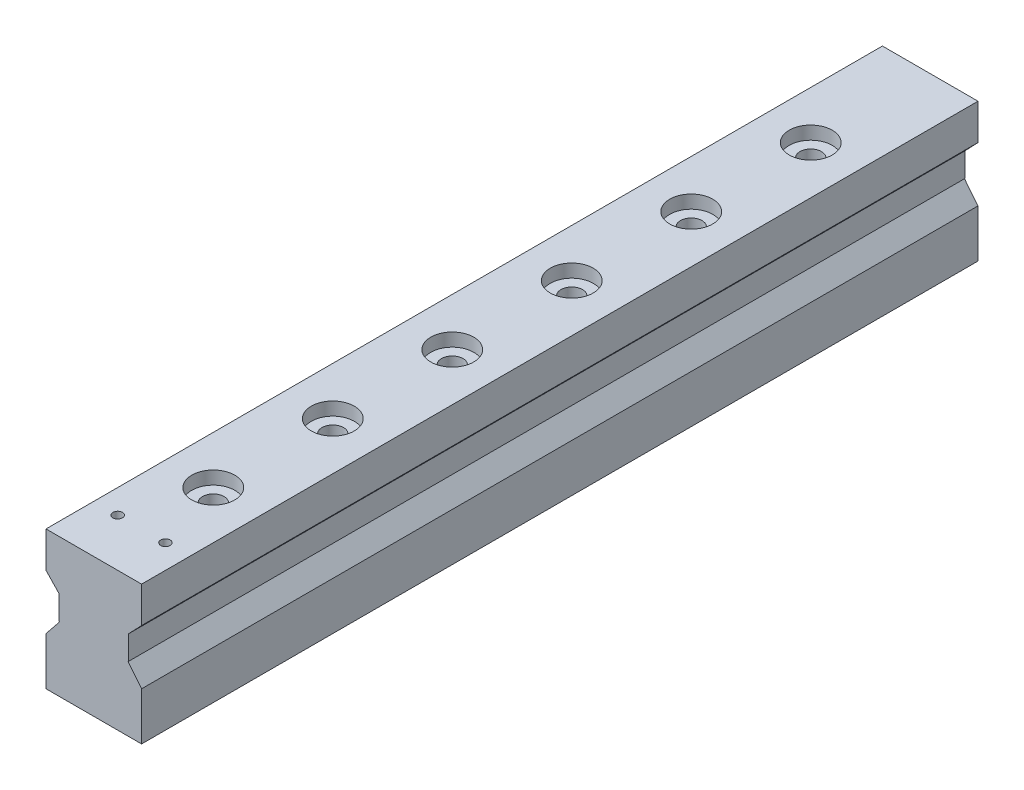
ISO-10303-21;
HEADER;
FILE_DESCRIPTION(('STEP AP214'),'2;1');
FILE_NAME('part.step','',(''),(''),'','','');
FILE_SCHEMA(('AUTOMOTIVE_DESIGN { 1 0 10303 214 1 1 1 1 }'));
ENDSEC;
DATA;
#1=APPLICATION_CONTEXT('core data for automotive mechanical design processes');
#2=APPLICATION_PROTOCOL_DEFINITION('international standard','automotive_design',2000,#1);
#3=PRODUCT_CONTEXT('',#1,'mechanical');
#4=PRODUCT('Part','Part','',(#3));
#5=PRODUCT_RELATED_PRODUCT_CATEGORY('part','',(#4));
#6=PRODUCT_DEFINITION_FORMATION('','',#4);
#7=PRODUCT_DEFINITION_CONTEXT('part definition',#1,'design');
#8=PRODUCT_DEFINITION('design','',#6,#7);
#9=PRODUCT_DEFINITION_SHAPE('','',#8);
#10=(LENGTH_UNIT() NAMED_UNIT(*) SI_UNIT(.MILLI.,.METRE.));
#11=(NAMED_UNIT(*) PLANE_ANGLE_UNIT() SI_UNIT($,.RADIAN.));
#12=(NAMED_UNIT(*) SI_UNIT($,.STERADIAN.) SOLID_ANGLE_UNIT());
#13=UNCERTAINTY_MEASURE_WITH_UNIT(LENGTH_MEASURE(1.E-05),#10,'distance_accuracy_value','');
#14=(GEOMETRIC_REPRESENTATION_CONTEXT(3) GLOBAL_UNCERTAINTY_ASSIGNED_CONTEXT((#13)) GLOBAL_UNIT_ASSIGNED_CONTEXT((#10,
#11,#12)) REPRESENTATION_CONTEXT('',''));
#15=CARTESIAN_POINT('',(0.,0.,0.));
#16=DIRECTION('',(0.,0.,1.));
#17=DIRECTION('',(1.,0.,0.));
#18=AXIS2_PLACEMENT_3D('',#15,#16,#17);
#19=CARTESIAN_POINT('',(-7.19228731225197,43.2311611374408,350.));
#20=DIRECTION('',(1.,0.,0.));
#21=DIRECTION('',(0.,1.,0.));
#22=AXIS2_PLACEMENT_3D('',#19,#20,#21);
#23=PLANE('',#22);
#24=DIRECTION('',(0.,-1.,0.));
#25=VECTOR('',#24,1.);
#26=CARTESIAN_POINT('',(-7.19228731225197,43.2311611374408,0.));
#27=LINE('',#26,#25);
#28=CARTESIAN_POINT('',(-7.19228731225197,43.2311611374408,0.));
#29=VERTEX_POINT('',#28);
#30=CARTESIAN_POINT('',(-7.19228731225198,28.2311611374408,0.));
#31=VERTEX_POINT('',#30);
#32=EDGE_CURVE('E170',#29,#31,#27,.T.);
#33=ORIENTED_EDGE('',*,*,#32,.T.);
#34=DIRECTION('',(0.,0.,-1.));
#35=VECTOR('',#34,1.);
#36=CARTESIAN_POINT('',(-7.19228731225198,28.2311611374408,350.));
#37=LINE('',#36,#35);
#38=CARTESIAN_POINT('',(-7.19228731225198,28.2311611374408,350.));
#39=VERTEX_POINT('',#38);
#40=EDGE_CURVE('E228',#39,#31,#37,.T.);
#41=ORIENTED_EDGE('',*,*,#40,.F.);
#42=DIRECTION('',(0.,-1.,0.));
#43=VECTOR('',#42,1.);
#44=CARTESIAN_POINT('',(-7.19228731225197,43.2311611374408,350.));
#45=LINE('',#44,#43);
#46=CARTESIAN_POINT('',(-7.19228731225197,43.2311611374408,350.));
#47=VERTEX_POINT('',#46);
#48=EDGE_CURVE('E197',#47,#39,#45,.T.);
#49=ORIENTED_EDGE('',*,*,#48,.F.);
#50=DIRECTION('',(0.,0.,-1.));
#51=VECTOR('',#50,1.);
#52=CARTESIAN_POINT('',(-7.19228731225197,43.2311611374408,350.));
#53=LINE('',#52,#51);
#54=EDGE_CURVE('E166',#47,#29,#53,.T.);
#55=ORIENTED_EDGE('',*,*,#54,.T.);
#56=EDGE_LOOP('',(#33,#41,#49,#55));
#57=FACE_BOUND('',#56,.T.);
#58=ADVANCED_FACE('F33',(#57),#23,.F.);
#59=CARTESIAN_POINT('',(-1.69228731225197,22.4619448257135,350.));
#60=DIRECTION('',(0.723792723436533,0.69001745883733,0.));
#61=DIRECTION('',(-0.69001745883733,0.723792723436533,0.));
#62=AXIS2_PLACEMENT_3D('',#59,#60,#61);
#63=PLANE('',#62);
#64=DIRECTION('',(0.69001745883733,-0.723792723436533,0.));
#65=VECTOR('',#64,1.);
#66=CARTESIAN_POINT('',(-1.69228731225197,22.4619448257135,0.));
#67=LINE('',#66,#65);
#68=CARTESIAN_POINT('',(-1.69228731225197,22.4619448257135,0.));
#69=VERTEX_POINT('',#68);
#70=EDGE_CURVE('E173',#31,#69,#67,.T.);
#71=ORIENTED_EDGE('',*,*,#70,.T.);
#72=DIRECTION('',(0.,0.,-1.));
#73=VECTOR('',#72,1.);
#74=CARTESIAN_POINT('',(-1.69228731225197,22.4619448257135,350.));
#75=LINE('',#74,#73);
#76=CARTESIAN_POINT('',(-1.69228731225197,22.4619448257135,350.));
#77=VERTEX_POINT('',#76);
#78=EDGE_CURVE('E225',#77,#69,#75,.T.);
#79=ORIENTED_EDGE('',*,*,#78,.F.);
#80=DIRECTION('',(0.69001745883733,-0.723792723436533,0.));
#81=VECTOR('',#80,1.);
#82=CARTESIAN_POINT('',(-1.69228731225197,22.4619448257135,350.));
#83=LINE('',#82,#81);
#84=EDGE_CURVE('E113',#39,#77,#83,.T.);
#85=ORIENTED_EDGE('',*,*,#84,.F.);
#86=ORIENTED_EDGE('',*,*,#40,.T.);
#87=EDGE_LOOP('',(#71,#79,#85,#86));
#88=FACE_BOUND('',#87,.T.);
#89=ADVANCED_FACE('F303',(#88),#63,.F.);
#90=CARTESIAN_POINT('',(-1.69228731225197,22.4619448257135,350.));
#91=DIRECTION('',(1.,0.,0.));
#92=DIRECTION('',(0.,0.,-1.));
#93=AXIS2_PLACEMENT_3D('',#90,#91,#92);
#94=PLANE('',#93);
#95=DIRECTION('',(0.,-1.,0.));
#96=VECTOR('',#95,1.);
#97=CARTESIAN_POINT('',(-1.69228731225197,22.4619448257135,0.));
#98=LINE('',#97,#96);
#99=CARTESIAN_POINT('',(-1.69228731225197,12.4619448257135,0.));
#100=VERTEX_POINT('',#99);
#101=EDGE_CURVE('E176',#69,#100,#98,.T.);
#102=ORIENTED_EDGE('',*,*,#101,.T.);
#103=DIRECTION('',(0.,0.,-1.));
#104=VECTOR('',#103,1.);
#105=CARTESIAN_POINT('',(-1.69228731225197,12.4619448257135,350.));
#106=LINE('',#105,#104);
#107=CARTESIAN_POINT('',(-1.69228731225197,12.4619448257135,350.));
#108=VERTEX_POINT('',#107);
#109=EDGE_CURVE('E222',#108,#100,#106,.T.);
#110=ORIENTED_EDGE('',*,*,#109,.F.);
#111=DIRECTION('',(0.,-1.,0.));
#112=VECTOR('',#111,1.);
#113=CARTESIAN_POINT('',(-1.69228731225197,22.4619448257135,350.));
#114=LINE('',#113,#112);
#115=EDGE_CURVE('E445',#77,#108,#114,.T.);
#116=ORIENTED_EDGE('',*,*,#115,.F.);
#117=ORIENTED_EDGE('',*,*,#78,.T.);
#118=EDGE_LOOP('',(#102,#110,#116,#117));
#119=FACE_BOUND('',#118,.T.);
#120=ADVANCED_FACE('F309',(#119),#94,.F.);
#121=CARTESIAN_POINT('',(-1.69228731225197,12.4619448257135,350.));
#122=DIRECTION('',(0.,1.,0.));
#123=DIRECTION('',(0.,0.,1.));
#124=AXIS2_PLACEMENT_3D('',#121,#122,#123);
#125=PLANE('',#124);
#126=DIRECTION('',(1.,0.,0.));
#127=VECTOR('',#126,1.);
#128=CARTESIAN_POINT('',(-1.69228731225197,12.4619448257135,0.));
#129=LINE('',#128,#127);
#130=CARTESIAN_POINT('',(-1.42307100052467,12.4619448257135,0.));
#131=VERTEX_POINT('',#130);
#132=EDGE_CURVE('E178',#100,#131,#129,.T.);
#133=ORIENTED_EDGE('',*,*,#132,.T.);
#134=DIRECTION('',(0.,0.,-1.));
#135=VECTOR('',#134,1.);
#136=CARTESIAN_POINT('',(-1.42307100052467,12.4619448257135,350.));
#137=LINE('',#136,#135);
#138=CARTESIAN_POINT('',(-1.42307100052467,12.4619448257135,350.));
#139=VERTEX_POINT('',#138);
#140=EDGE_CURVE('E219',#139,#131,#137,.T.);
#141=ORIENTED_EDGE('',*,*,#140,.F.);
#142=DIRECTION('',(1.,0.,0.));
#143=VECTOR('',#142,1.);
#144=CARTESIAN_POINT('',(-1.69228731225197,12.4619448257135,350.));
#145=LINE('',#144,#143);
#146=EDGE_CURVE('E400',#108,#139,#145,.T.);
#147=ORIENTED_EDGE('',*,*,#146,.F.);
#148=ORIENTED_EDGE('',*,*,#109,.T.);
#149=EDGE_LOOP('',(#133,#141,#147,#148));
#150=FACE_BOUND('',#149,.T.);
#151=ADVANCED_FACE('F385',(#150),#125,.F.);
#152=CARTESIAN_POINT('',(-1.42307100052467,12.4619448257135,350.));
#153=DIRECTION('',(0.779014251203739,-0.627006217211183,0.));
#154=DIRECTION('',(0.627006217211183,0.779014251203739,0.));
#155=AXIS2_PLACEMENT_3D('',#152,#153,#154);
#156=PLANE('',#155);
#157=DIRECTION('',(-0.627006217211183,-0.779014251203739,0.));
#158=VECTOR('',#157,1.);
#159=CARTESIAN_POINT('',(-1.42307100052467,12.4619448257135,0.));
#160=LINE('',#159,#158);
#161=CARTESIAN_POINT('',(-7.19228731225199,5.29407056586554,0.));
#162=VERTEX_POINT('',#161);
#163=EDGE_CURVE('E180',#131,#162,#160,.T.);
#164=ORIENTED_EDGE('',*,*,#163,.T.);
#165=DIRECTION('',(0.,0.,-1.));
#166=VECTOR('',#165,1.);
#167=CARTESIAN_POINT('',(-7.19228731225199,5.29407056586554,350.));
#168=LINE('',#167,#166);
#169=CARTESIAN_POINT('',(-7.19228731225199,5.29407056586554,350.));
#170=VERTEX_POINT('',#169);
#171=EDGE_CURVE('E216',#170,#162,#168,.T.);
#172=ORIENTED_EDGE('',*,*,#171,.F.);
#173=DIRECTION('',(-0.627006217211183,-0.779014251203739,0.));
#174=VECTOR('',#173,1.);
#175=CARTESIAN_POINT('',(-1.42307100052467,12.4619448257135,350.));
#176=LINE('',#175,#174);
#177=EDGE_CURVE('E412',#139,#170,#176,.T.);
#178=ORIENTED_EDGE('',*,*,#177,.F.);
#179=ORIENTED_EDGE('',*,*,#140,.T.);
#180=EDGE_LOOP('',(#164,#172,#178,#179));
#181=FACE_BOUND('',#180,.T.);
#182=ADVANCED_FACE('F376',(#181),#156,.F.);
#183=CARTESIAN_POINT('',(-7.19228731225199,5.29407056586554,350.));
#184=DIRECTION('',(1.,0.,0.));
#185=DIRECTION('',(0.,1.,0.));
#186=AXIS2_PLACEMENT_3D('',#183,#184,#185);
#187=PLANE('',#186);
#188=DIRECTION('',(0.,-1.,0.));
#189=VECTOR('',#188,1.);
#190=CARTESIAN_POINT('',(-7.19228731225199,5.29407056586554,0.));
#191=LINE('',#190,#189);
#192=CARTESIAN_POINT('',(-7.19228731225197,-14.7059294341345,0.));
#193=VERTEX_POINT('',#192);
#194=EDGE_CURVE('E182',#162,#193,#191,.T.);
#195=ORIENTED_EDGE('',*,*,#194,.T.);
#196=DIRECTION('',(0.,0.,-1.));
#197=VECTOR('',#196,1.);
#198=CARTESIAN_POINT('',(-7.19228731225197,-14.7059294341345,350.));
#199=LINE('',#198,#197);
#200=CARTESIAN_POINT('',(-7.19228731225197,-14.7059294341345,350.));
#201=VERTEX_POINT('',#200);
#202=EDGE_CURVE('E213',#201,#193,#199,.T.);
#203=ORIENTED_EDGE('',*,*,#202,.F.);
#204=DIRECTION('',(0.,-1.,0.));
#205=VECTOR('',#204,1.);
#206=CARTESIAN_POINT('',(-7.19228731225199,5.29407056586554,350.));
#207=LINE('',#206,#205);
#208=EDGE_CURVE('E409',#170,#201,#207,.T.);
#209=ORIENTED_EDGE('',*,*,#208,.F.);
#210=ORIENTED_EDGE('',*,*,#171,.T.);
#211=EDGE_LOOP('',(#195,#203,#209,#210));
#212=FACE_BOUND('',#211,.T.);
#213=ADVANCED_FACE('F364',(#212),#187,.F.);
#214=CARTESIAN_POINT('',(-7.19228731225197,-14.7059294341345,350.));
#215=DIRECTION('',(0.,1.,0.));
#216=DIRECTION('',(0.,0.,1.));
#217=AXIS2_PLACEMENT_3D('',#214,#215,#216);
#218=PLANE('',#217);
#219=CARTESIAN_POINT('',(12.807712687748,-14.7059294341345,100.));
#220=DIRECTION('',(0.,1.,0.));
#221=DIRECTION('',(0.,0.,1.));
#222=AXIS2_PLACEMENT_3D('',#219,#220,#221);
#223=CIRCLE('',#222,4.49999999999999);
#224=CARTESIAN_POINT('',(12.807712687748,-14.7059294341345,104.5));
#225=VERTEX_POINT('',#224);
#226=EDGE_CURVE('E466',#225,#225,#223,.T.);
#227=ORIENTED_EDGE('',*,*,#226,.T.);
#228=EDGE_LOOP('',(#227));
#229=FACE_BOUND('',#228,.T.);
#230=CARTESIAN_POINT('',(12.807712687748,-14.7059294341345,50.));
#231=DIRECTION('',(0.,1.,0.));
#232=DIRECTION('',(0.,0.,1.));
#233=AXIS2_PLACEMENT_3D('',#230,#231,#232);
#234=CIRCLE('',#233,4.49999999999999);
#235=CARTESIAN_POINT('',(12.807712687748,-14.7059294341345,54.5));
#236=VERTEX_POINT('',#235);
#237=EDGE_CURVE('E174',#236,#236,#234,.T.);
#238=ORIENTED_EDGE('',*,*,#237,.T.);
#239=EDGE_LOOP('',(#238));
#240=FACE_BOUND('',#239,.T.);
#241=DIRECTION('',(1.,0.,0.));
#242=VECTOR('',#241,1.);
#243=CARTESIAN_POINT('',(-7.19228731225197,-14.7059294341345,0.));
#244=LINE('',#243,#242);
#245=CARTESIAN_POINT('',(32.807712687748,-14.7059294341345,0.));
#246=VERTEX_POINT('',#245);
#247=EDGE_CURVE('E184',#193,#246,#244,.T.);
#248=ORIENTED_EDGE('',*,*,#247,.T.);
#249=DIRECTION('',(0.,0.,-1.));
#250=VECTOR('',#249,1.);
#251=CARTESIAN_POINT('',(32.807712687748,-14.7059294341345,350.));
#252=LINE('',#251,#250);
#253=CARTESIAN_POINT('',(32.807712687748,-14.7059294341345,350.));
#254=VERTEX_POINT('',#253);
#255=EDGE_CURVE('E210',#254,#246,#252,.T.);
#256=ORIENTED_EDGE('',*,*,#255,.F.);
#257=DIRECTION('',(1.,0.,0.));
#258=VECTOR('',#257,1.);
#259=CARTESIAN_POINT('',(-7.19228731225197,-14.7059294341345,350.));
#260=LINE('',#259,#258);
#261=EDGE_CURVE('E411',#201,#254,#260,.T.);
#262=ORIENTED_EDGE('',*,*,#261,.F.);
#263=ORIENTED_EDGE('',*,*,#202,.T.);
#264=EDGE_LOOP('',(#248,#256,#262,#263));
#265=FACE_BOUND('',#264,.T.);
#266=CARTESIAN_POINT('',(12.807712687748,-14.7059294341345,150.));
#267=DIRECTION('',(0.,1.,0.));
#268=DIRECTION('',(0.,0.,1.));
#269=AXIS2_PLACEMENT_3D('',#266,#267,#268);
#270=CIRCLE('',#269,4.49999999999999);
#271=CARTESIAN_POINT('',(12.807712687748,-14.7059294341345,154.5));
#272=VERTEX_POINT('',#271);
#273=EDGE_CURVE('E233',#272,#272,#270,.T.);
#274=ORIENTED_EDGE('',*,*,#273,.T.);
#275=EDGE_LOOP('',(#274));
#276=FACE_BOUND('',#275,.T.);
#277=CARTESIAN_POINT('',(12.807712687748,-14.7059294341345,200.));
#278=DIRECTION('',(0.,1.,0.));
#279=DIRECTION('',(0.,0.,1.));
#280=AXIS2_PLACEMENT_3D('',#277,#278,#279);
#281=CIRCLE('',#280,4.49999999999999);
#282=CARTESIAN_POINT('',(12.807712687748,-14.7059294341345,204.5));
#283=VERTEX_POINT('',#282);
#284=EDGE_CURVE('E245',#283,#283,#281,.T.);
#285=ORIENTED_EDGE('',*,*,#284,.T.);
#286=EDGE_LOOP('',(#285));
#287=FACE_BOUND('',#286,.T.);
#288=CARTESIAN_POINT('',(12.807712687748,-14.7059294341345,250.));
#289=DIRECTION('',(0.,1.,0.));
#290=DIRECTION('',(0.,0.,1.));
#291=AXIS2_PLACEMENT_3D('',#288,#289,#290);
#292=CIRCLE('',#291,4.49999999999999);
#293=CARTESIAN_POINT('',(12.807712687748,-14.7059294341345,254.5));
#294=VERTEX_POINT('',#293);
#295=EDGE_CURVE('E257',#294,#294,#292,.T.);
#296=ORIENTED_EDGE('',*,*,#295,.T.);
#297=EDGE_LOOP('',(#296));
#298=FACE_BOUND('',#297,.T.);
#299=CARTESIAN_POINT('',(12.807712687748,-14.7059294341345,300.));
#300=DIRECTION('',(0.,1.,0.));
#301=DIRECTION('',(0.,0.,1.));
#302=AXIS2_PLACEMENT_3D('',#299,#300,#301);
#303=CIRCLE('',#302,4.49999999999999);
#304=CARTESIAN_POINT('',(12.807712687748,-14.7059294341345,304.5));
#305=VERTEX_POINT('',#304);
#306=EDGE_CURVE('E269',#305,#305,#303,.T.);
#307=ORIENTED_EDGE('',*,*,#306,.T.);
#308=EDGE_LOOP('',(#307));
#309=FACE_BOUND('',#308,.T.);
#310=ADVANCED_FACE('F361',(#229,#240,#265,#276,#287,#298,#309),#218,.F.);
#311=CARTESIAN_POINT('',(32.807712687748,5.29407056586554,350.));
#312=DIRECTION('',(-1.,0.,0.));
#313=DIRECTION('',(0.,-1.,0.));
#314=AXIS2_PLACEMENT_3D('',#311,#312,#313);
#315=PLANE('',#314);
#316=DIRECTION('',(0.,1.,0.));
#317=VECTOR('',#316,1.);
#318=CARTESIAN_POINT('',(32.807712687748,5.29407056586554,0.));
#319=LINE('',#318,#317);
#320=CARTESIAN_POINT('',(32.807712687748,5.29407056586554,0.));
#321=VERTEX_POINT('',#320);
#322=EDGE_CURVE('E186',#246,#321,#319,.T.);
#323=ORIENTED_EDGE('',*,*,#322,.T.);
#324=DIRECTION('',(0.,0.,-1.));
#325=VECTOR('',#324,1.);
#326=CARTESIAN_POINT('',(32.807712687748,5.29407056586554,350.));
#327=LINE('',#326,#325);
#328=CARTESIAN_POINT('',(32.807712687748,5.29407056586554,350.));
#329=VERTEX_POINT('',#328);
#330=EDGE_CURVE('E207',#329,#321,#327,.T.);
#331=ORIENTED_EDGE('',*,*,#330,.F.);
#332=DIRECTION('',(0.,1.,0.));
#333=VECTOR('',#332,1.);
#334=CARTESIAN_POINT('',(32.807712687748,5.29407056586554,350.));
#335=LINE('',#334,#333);
#336=EDGE_CURVE('E414',#254,#329,#335,.T.);
#337=ORIENTED_EDGE('',*,*,#336,.F.);
#338=ORIENTED_EDGE('',*,*,#255,.T.);
#339=EDGE_LOOP('',(#323,#331,#337,#338));
#340=FACE_BOUND('',#339,.T.);
#341=ADVANCED_FACE('F363',(#340),#315,.F.);
#342=CARTESIAN_POINT('',(27.0384963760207,12.4619448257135,350.));
#343=DIRECTION('',(-0.779014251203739,-0.627006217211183,0.));
#344=DIRECTION('',(0.627006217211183,-0.779014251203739,0.));
#345=AXIS2_PLACEMENT_3D('',#342,#343,#344);
#346=PLANE('',#345);
#347=DIRECTION('',(-0.627006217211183,0.779014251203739,0.));
#348=VECTOR('',#347,1.);
#349=CARTESIAN_POINT('',(27.0384963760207,12.4619448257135,0.));
#350=LINE('',#349,#348);
#351=CARTESIAN_POINT('',(27.0384963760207,12.4619448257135,0.));
#352=VERTEX_POINT('',#351);
#353=EDGE_CURVE('E188',#321,#352,#350,.T.);
#354=ORIENTED_EDGE('',*,*,#353,.T.);
#355=DIRECTION('',(0.,0.,-1.));
#356=VECTOR('',#355,1.);
#357=CARTESIAN_POINT('',(27.0384963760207,12.4619448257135,350.));
#358=LINE('',#357,#356);
#359=CARTESIAN_POINT('',(27.0384963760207,12.4619448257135,350.));
#360=VERTEX_POINT('',#359);
#361=EDGE_CURVE('E204',#360,#352,#358,.T.);
#362=ORIENTED_EDGE('',*,*,#361,.F.);
#363=DIRECTION('',(-0.627006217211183,0.779014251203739,0.));
#364=VECTOR('',#363,1.);
#365=CARTESIAN_POINT('',(27.0384963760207,12.4619448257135,350.));
#366=LINE('',#365,#364);
#367=EDGE_CURVE('E420',#329,#360,#366,.T.);
#368=ORIENTED_EDGE('',*,*,#367,.F.);
#369=ORIENTED_EDGE('',*,*,#330,.T.);
#370=EDGE_LOOP('',(#354,#362,#368,#369));
#371=FACE_BOUND('',#370,.T.);
#372=ADVANCED_FACE('F372',(#371),#346,.F.);
#373=CARTESIAN_POINT('',(27.307712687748,12.4619448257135,350.));
#374=DIRECTION('',(0.,1.,0.));
#375=DIRECTION('',(-1.,0.,0.));
#376=AXIS2_PLACEMENT_3D('',#373,#374,#375);
#377=PLANE('',#376);
#378=DIRECTION('',(1.,0.,0.));
#379=VECTOR('',#378,1.);
#380=CARTESIAN_POINT('',(27.307712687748,12.4619448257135,0.));
#381=LINE('',#380,#379);
#382=CARTESIAN_POINT('',(27.307712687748,12.4619448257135,0.));
#383=VERTEX_POINT('',#382);
#384=EDGE_CURVE('E190',#352,#383,#381,.T.);
#385=ORIENTED_EDGE('',*,*,#384,.T.);
#386=DIRECTION('',(0.,0.,-1.));
#387=VECTOR('',#386,1.);
#388=CARTESIAN_POINT('',(27.307712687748,12.4619448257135,350.));
#389=LINE('',#388,#387);
#390=CARTESIAN_POINT('',(27.307712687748,12.4619448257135,350.));
#391=VERTEX_POINT('',#390);
#392=EDGE_CURVE('E201',#391,#383,#389,.T.);
#393=ORIENTED_EDGE('',*,*,#392,.F.);
#394=DIRECTION('',(1.,0.,0.));
#395=VECTOR('',#394,1.);
#396=CARTESIAN_POINT('',(27.307712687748,12.4619448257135,350.));
#397=LINE('',#396,#395);
#398=EDGE_CURVE('E422',#360,#391,#397,.T.);
#399=ORIENTED_EDGE('',*,*,#398,.F.);
#400=ORIENTED_EDGE('',*,*,#361,.T.);
#401=EDGE_LOOP('',(#385,#393,#399,#400));
#402=FACE_BOUND('',#401,.T.);
#403=ADVANCED_FACE('F428',(#402),#377,.F.);
#404=CARTESIAN_POINT('',(27.307712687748,22.4619448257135,350.));
#405=DIRECTION('',(-1.,0.,0.));
#406=DIRECTION('',(0.,0.,1.));
#407=AXIS2_PLACEMENT_3D('',#404,#405,#406);
#408=PLANE('',#407);
#409=DIRECTION('',(0.,1.,0.));
#410=VECTOR('',#409,1.);
#411=CARTESIAN_POINT('',(27.307712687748,22.4619448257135,0.));
#412=LINE('',#411,#410);
#413=CARTESIAN_POINT('',(27.307712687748,22.4619448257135,0.));
#414=VERTEX_POINT('',#413);
#415=EDGE_CURVE('E192',#383,#414,#412,.T.);
#416=ORIENTED_EDGE('',*,*,#415,.T.);
#417=DIRECTION('',(0.,0.,-1.));
#418=VECTOR('',#417,1.);
#419=CARTESIAN_POINT('',(27.307712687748,22.4619448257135,350.));
#420=LINE('',#419,#418);
#421=CARTESIAN_POINT('',(27.307712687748,22.4619448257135,350.));
#422=VERTEX_POINT('',#421);
#423=EDGE_CURVE('E161',#422,#414,#420,.T.);
#424=ORIENTED_EDGE('',*,*,#423,.F.);
#425=DIRECTION('',(0.,1.,0.));
#426=VECTOR('',#425,1.);
#427=CARTESIAN_POINT('',(27.307712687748,22.4619448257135,350.));
#428=LINE('',#427,#426);
#429=EDGE_CURVE('E152',#391,#422,#428,.T.);
#430=ORIENTED_EDGE('',*,*,#429,.F.);
#431=ORIENTED_EDGE('',*,*,#392,.T.);
#432=EDGE_LOOP('',(#416,#424,#430,#431));
#433=FACE_BOUND('',#432,.T.);
#434=ADVANCED_FACE('F432',(#433),#408,.F.);
#435=CARTESIAN_POINT('',(32.807712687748,28.2311611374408,350.));
#436=DIRECTION('',(-0.723792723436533,0.69001745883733,0.));
#437=DIRECTION('',(-0.69001745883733,-0.723792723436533,0.));
#438=AXIS2_PLACEMENT_3D('',#435,#436,#437);
#439=PLANE('',#438);
#440=DIRECTION('',(0.69001745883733,0.723792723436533,0.));
#441=VECTOR('',#440,1.);
#442=CARTESIAN_POINT('',(32.807712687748,28.2311611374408,0.));
#443=LINE('',#442,#441);
#444=CARTESIAN_POINT('',(32.807712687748,28.2311611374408,0.));
#445=VERTEX_POINT('',#444);
#446=EDGE_CURVE('E160',#414,#445,#443,.T.);
#447=ORIENTED_EDGE('',*,*,#446,.T.);
#448=DIRECTION('',(0.,0.,-1.));
#449=VECTOR('',#448,1.);
#450=CARTESIAN_POINT('',(32.807712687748,28.2311611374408,350.));
#451=LINE('',#450,#449);
#452=CARTESIAN_POINT('',(32.807712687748,28.2311611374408,350.));
#453=VERTEX_POINT('',#452);
#454=EDGE_CURVE('E157',#453,#445,#451,.T.);
#455=ORIENTED_EDGE('',*,*,#454,.F.);
#456=DIRECTION('',(0.69001745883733,0.723792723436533,0.));
#457=VECTOR('',#456,1.);
#458=CARTESIAN_POINT('',(32.807712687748,28.2311611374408,350.));
#459=LINE('',#458,#457);
#460=EDGE_CURVE('E146',#422,#453,#459,.T.);
#461=ORIENTED_EDGE('',*,*,#460,.F.);
#462=ORIENTED_EDGE('',*,*,#423,.T.);
#463=EDGE_LOOP('',(#447,#455,#461,#462));
#464=FACE_BOUND('',#463,.T.);
#465=ADVANCED_FACE('F158',(#464),#439,.F.);
#466=CARTESIAN_POINT('',(32.807712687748,43.2311611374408,350.));
#467=DIRECTION('',(-1.,0.,0.));
#468=DIRECTION('',(0.,-1.,0.));
#469=AXIS2_PLACEMENT_3D('',#466,#467,#468);
#470=PLANE('',#469);
#471=DIRECTION('',(0.,1.,0.));
#472=VECTOR('',#471,1.);
#473=CARTESIAN_POINT('',(32.807712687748,43.2311611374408,0.));
#474=LINE('',#473,#472);
#475=CARTESIAN_POINT('',(32.807712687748,43.2311611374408,0.));
#476=VERTEX_POINT('',#475);
#477=EDGE_CURVE('E98',#445,#476,#474,.T.);
#478=ORIENTED_EDGE('',*,*,#477,.T.);
#479=DIRECTION('',(0.,0.,-1.));
#480=VECTOR('',#479,1.);
#481=CARTESIAN_POINT('',(32.807712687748,43.2311611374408,350.));
#482=LINE('',#481,#480);
#483=CARTESIAN_POINT('',(32.807712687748,43.2311611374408,350.));
#484=VERTEX_POINT('',#483);
#485=EDGE_CURVE('E162',#484,#476,#482,.T.);
#486=ORIENTED_EDGE('',*,*,#485,.F.);
#487=DIRECTION('',(0.,1.,0.));
#488=VECTOR('',#487,1.);
#489=CARTESIAN_POINT('',(32.807712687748,43.2311611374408,350.));
#490=LINE('',#489,#488);
#491=EDGE_CURVE('E150',#453,#484,#490,.T.);
#492=ORIENTED_EDGE('',*,*,#491,.F.);
#493=ORIENTED_EDGE('',*,*,#454,.T.);
#494=EDGE_LOOP('',(#478,#486,#492,#493));
#495=FACE_BOUND('',#494,.T.);
#496=ADVANCED_FACE('F164',(#495),#470,.F.);
#497=CARTESIAN_POINT('',(32.807712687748,43.2311611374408,350.));
#498=DIRECTION('',(0.,-1.,0.));
#499=DIRECTION('',(0.,0.,-1.));
#500=AXIS2_PLACEMENT_3D('',#497,#498,#499);
#501=PLANE('',#500);
#502=CARTESIAN_POINT('',(2.80771268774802,43.2311611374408,330.));
#503=DIRECTION('',(0.,1.,0.));
#504=DIRECTION('',(0.,0.,1.));
#505=AXIS2_PLACEMENT_3D('',#502,#503,#504);
#506=CIRCLE('',#505,1.99999999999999);
#507=CARTESIAN_POINT('',(2.80771268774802,43.2311611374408,332.));
#508=VERTEX_POINT('',#507);
#509=EDGE_CURVE('E480',#508,#508,#506,.T.);
#510=ORIENTED_EDGE('',*,*,#509,.F.);
#511=EDGE_LOOP('',(#510));
#512=FACE_BOUND('',#511,.T.);
#513=CARTESIAN_POINT('',(22.807712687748,43.2311611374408,330.));
#514=DIRECTION('',(0.,1.,0.));
#515=DIRECTION('',(0.,0.,1.));
#516=AXIS2_PLACEMENT_3D('',#513,#514,#515);
#517=CIRCLE('',#516,1.99999999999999);
#518=CARTESIAN_POINT('',(22.807712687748,43.2311611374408,332.));
#519=VERTEX_POINT('',#518);
#520=EDGE_CURVE('E474',#519,#519,#517,.T.);
#521=ORIENTED_EDGE('',*,*,#520,.F.);
#522=EDGE_LOOP('',(#521));
#523=FACE_BOUND('',#522,.T.);
#524=CARTESIAN_POINT('',(12.807712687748,43.2311611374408,100.));
#525=DIRECTION('',(0.,1.,0.));
#526=DIRECTION('',(0.,0.,1.));
#527=AXIS2_PLACEMENT_3D('',#524,#525,#526);
#528=CIRCLE('',#527,9.005);
#529=CARTESIAN_POINT('',(12.807712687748,43.2311611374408,109.005));
#530=VERTEX_POINT('',#529);
#531=EDGE_CURVE('E468',#530,#530,#528,.T.);
#532=ORIENTED_EDGE('',*,*,#531,.F.);
#533=EDGE_LOOP('',(#532));
#534=FACE_BOUND('',#533,.T.);
#535=CARTESIAN_POINT('',(12.807712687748,43.2311611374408,50.));
#536=DIRECTION('',(0.,1.,0.));
#537=DIRECTION('',(0.,0.,1.));
#538=AXIS2_PLACEMENT_3D('',#535,#536,#537);
#539=CIRCLE('',#538,9.005);
#540=CARTESIAN_POINT('',(12.807712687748,43.2311611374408,59.005));
#541=VERTEX_POINT('',#540);
#542=EDGE_CURVE('E457',#541,#541,#539,.T.);
#543=ORIENTED_EDGE('',*,*,#542,.F.);
#544=EDGE_LOOP('',(#543));
#545=FACE_BOUND('',#544,.T.);
#546=DIRECTION('',(-1.,0.,0.));
#547=VECTOR('',#546,1.);
#548=CARTESIAN_POINT('',(32.807712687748,43.2311611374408,0.));
#549=LINE('',#548,#547);
#550=EDGE_CURVE('E104',#476,#29,#549,.T.);
#551=ORIENTED_EDGE('',*,*,#550,.T.);
#552=ORIENTED_EDGE('',*,*,#54,.F.);
#553=DIRECTION('',(-1.,0.,0.));
#554=VECTOR('',#553,1.);
#555=CARTESIAN_POINT('',(32.807712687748,43.2311611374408,350.));
#556=LINE('',#555,#554);
#557=EDGE_CURVE('E50',#484,#47,#556,.T.);
#558=ORIENTED_EDGE('',*,*,#557,.F.);
#559=ORIENTED_EDGE('',*,*,#485,.T.);
#560=EDGE_LOOP('',(#551,#552,#558,#559));
#561=FACE_BOUND('',#560,.T.);
#562=CARTESIAN_POINT('',(12.807712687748,43.2311611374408,150.));
#563=DIRECTION('',(0.,1.,0.));
#564=DIRECTION('',(0.,0.,1.));
#565=AXIS2_PLACEMENT_3D('',#562,#563,#564);
#566=CIRCLE('',#565,9.005);
#567=CARTESIAN_POINT('',(12.807712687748,43.2311611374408,159.005));
#568=VERTEX_POINT('',#567);
#569=EDGE_CURVE('E230',#568,#568,#566,.T.);
#570=ORIENTED_EDGE('',*,*,#569,.F.);
#571=EDGE_LOOP('',(#570));
#572=FACE_BOUND('',#571,.T.);
#573=CARTESIAN_POINT('',(12.807712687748,43.2311611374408,200.));
#574=DIRECTION('',(0.,1.,0.));
#575=DIRECTION('',(0.,0.,1.));
#576=AXIS2_PLACEMENT_3D('',#573,#574,#575);
#577=CIRCLE('',#576,9.005);
#578=CARTESIAN_POINT('',(12.807712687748,43.2311611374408,209.005));
#579=VERTEX_POINT('',#578);
#580=EDGE_CURVE('E242',#579,#579,#577,.T.);
#581=ORIENTED_EDGE('',*,*,#580,.F.);
#582=EDGE_LOOP('',(#581));
#583=FACE_BOUND('',#582,.T.);
#584=CARTESIAN_POINT('',(12.807712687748,43.2311611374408,250.));
#585=DIRECTION('',(0.,1.,0.));
#586=DIRECTION('',(0.,0.,1.));
#587=AXIS2_PLACEMENT_3D('',#584,#585,#586);
#588=CIRCLE('',#587,9.005);
#589=CARTESIAN_POINT('',(12.807712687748,43.2311611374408,259.005));
#590=VERTEX_POINT('',#589);
#591=EDGE_CURVE('E254',#590,#590,#588,.T.);
#592=ORIENTED_EDGE('',*,*,#591,.F.);
#593=EDGE_LOOP('',(#592));
#594=FACE_BOUND('',#593,.T.);
#595=CARTESIAN_POINT('',(12.807712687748,43.2311611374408,300.));
#596=DIRECTION('',(0.,1.,0.));
#597=DIRECTION('',(0.,0.,1.));
#598=AXIS2_PLACEMENT_3D('',#595,#596,#597);
#599=CIRCLE('',#598,9.005);
#600=CARTESIAN_POINT('',(12.807712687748,43.2311611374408,309.005));
#601=VERTEX_POINT('',#600);
#602=EDGE_CURVE('E266',#601,#601,#599,.T.);
#603=ORIENTED_EDGE('',*,*,#602,.F.);
#604=EDGE_LOOP('',(#603));
#605=FACE_BOUND('',#604,.T.);
#606=ADVANCED_FACE('F286',(#512,#523,#534,#545,#561,#572,#583,#594,#605),#501,.F.);
#607=CARTESIAN_POINT('',(0.,0.,350.));
#608=DIRECTION('',(0.,0.,1.));
#609=DIRECTION('',(1.,0.,0.));
#610=AXIS2_PLACEMENT_3D('',#607,#608,#609);
#611=PLANE('',#610);
#612=ORIENTED_EDGE('',*,*,#48,.T.);
#613=ORIENTED_EDGE('',*,*,#84,.T.);
#614=ORIENTED_EDGE('',*,*,#115,.T.);
#615=ORIENTED_EDGE('',*,*,#146,.T.);
#616=ORIENTED_EDGE('',*,*,#177,.T.);
#617=ORIENTED_EDGE('',*,*,#208,.T.);
#618=ORIENTED_EDGE('',*,*,#261,.T.);
#619=ORIENTED_EDGE('',*,*,#336,.T.);
#620=ORIENTED_EDGE('',*,*,#367,.T.);
#621=ORIENTED_EDGE('',*,*,#398,.T.);
#622=ORIENTED_EDGE('',*,*,#429,.T.);
#623=ORIENTED_EDGE('',*,*,#460,.T.);
#624=ORIENTED_EDGE('',*,*,#491,.T.);
#625=ORIENTED_EDGE('',*,*,#557,.T.);
#626=EDGE_LOOP('',(#612,#613,#614,#615,#616,#617,#618,#619,#620,#621,#622,#623,#624,#625));
#627=FACE_BOUND('',#626,.T.);
#628=ADVANCED_FACE('F148',(#627),#611,.T.);
#629=CARTESIAN_POINT('',(0.,0.,0.));
#630=DIRECTION('',(0.,0.,1.));
#631=DIRECTION('',(1.,0.,0.));
#632=AXIS2_PLACEMENT_3D('',#629,#630,#631);
#633=PLANE('',#632);
#634=ORIENTED_EDGE('',*,*,#32,.F.);
#635=ORIENTED_EDGE('',*,*,#550,.F.);
#636=ORIENTED_EDGE('',*,*,#477,.F.);
#637=ORIENTED_EDGE('',*,*,#446,.F.);
#638=ORIENTED_EDGE('',*,*,#415,.F.);
#639=ORIENTED_EDGE('',*,*,#384,.F.);
#640=ORIENTED_EDGE('',*,*,#353,.F.);
#641=ORIENTED_EDGE('',*,*,#322,.F.);
#642=ORIENTED_EDGE('',*,*,#247,.F.);
#643=ORIENTED_EDGE('',*,*,#194,.F.);
#644=ORIENTED_EDGE('',*,*,#163,.F.);
#645=ORIENTED_EDGE('',*,*,#132,.F.);
#646=ORIENTED_EDGE('',*,*,#101,.F.);
#647=ORIENTED_EDGE('',*,*,#70,.F.);
#648=EDGE_LOOP('',(#634,#635,#636,#637,#638,#639,#640,#641,#642,#643,#644,#645,#646,#647));
#649=FACE_BOUND('',#648,.T.);
#650=ADVANCED_FACE('F295',(#649),#633,.F.);
#651=CARTESIAN_POINT('',(12.807712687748,43.2311611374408,50.));
#652=DIRECTION('',(0.,1.,0.));
#653=DIRECTION('',(0.,0.,1.));
#654=AXIS2_PLACEMENT_3D('',#651,#652,#653);
#655=CYLINDRICAL_SURFACE('',#654,4.5);
#656=ORIENTED_EDGE('',*,*,#237,.F.);
#657=EDGE_LOOP('',(#656));
#658=FACE_BOUND('',#657,.T.);
#659=CARTESIAN_POINT('',(12.807712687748,37.7311611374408,50.));
#660=DIRECTION('',(0.,1.,0.));
#661=DIRECTION('',(0.,0.,1.));
#662=AXIS2_PLACEMENT_3D('',#659,#660,#661);
#663=CIRCLE('',#662,4.50000000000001);
#664=CARTESIAN_POINT('',(12.807712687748,37.7311611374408,54.5));
#665=VERTEX_POINT('',#664);
#666=EDGE_CURVE('E451',#665,#665,#663,.T.);
#667=ORIENTED_EDGE('',*,*,#666,.T.);
#668=EDGE_LOOP('',(#667));
#669=FACE_BOUND('',#668,.T.);
#670=ADVANCED_FACE('F515',(#658,#669),#655,.F.);
#671=CARTESIAN_POINT('',(17.307712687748,37.7311611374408,50.));
#672=DIRECTION('',(0.,-1.,0.));
#673=DIRECTION('',(0.,0.,-1.));
#674=AXIS2_PLACEMENT_3D('',#671,#672,#673);
#675=PLANE('',#674);
#676=ORIENTED_EDGE('',*,*,#666,.F.);
#677=EDGE_LOOP('',(#676));
#678=FACE_BOUND('',#677,.T.);
#679=CARTESIAN_POINT('',(12.807712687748,37.7311611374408,50.));
#680=DIRECTION('',(0.,1.,0.));
#681=DIRECTION('',(0.,0.,1.));
#682=AXIS2_PLACEMENT_3D('',#679,#680,#681);
#683=CIRCLE('',#682,9.005);
#684=CARTESIAN_POINT('',(12.807712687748,37.7311611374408,59.005));
#685=VERTEX_POINT('',#684);
#686=EDGE_CURVE('E454',#685,#685,#683,.T.);
#687=ORIENTED_EDGE('',*,*,#686,.T.);
#688=EDGE_LOOP('',(#687));
#689=FACE_BOUND('',#688,.T.);
#690=ADVANCED_FACE('F511',(#678,#689),#675,.F.);
#691=CARTESIAN_POINT('',(12.807712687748,43.2311611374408,50.));
#692=DIRECTION('',(0.,1.,0.));
#693=DIRECTION('',(0.,0.,1.));
#694=AXIS2_PLACEMENT_3D('',#691,#692,#693);
#695=CYLINDRICAL_SURFACE('',#694,9.005);
#696=ORIENTED_EDGE('',*,*,#686,.F.);
#697=EDGE_LOOP('',(#696));
#698=FACE_BOUND('',#697,.T.);
#699=ORIENTED_EDGE('',*,*,#542,.T.);
#700=EDGE_LOOP('',(#699));
#701=FACE_BOUND('',#700,.T.);
#702=ADVANCED_FACE('F507',(#698,#701),#695,.F.);
#703=CARTESIAN_POINT('',(12.807712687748,43.2311611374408,100.));
#704=DIRECTION('',(0.,1.,0.));
#705=DIRECTION('',(0.,0.,1.));
#706=AXIS2_PLACEMENT_3D('',#703,#704,#705);
#707=CYLINDRICAL_SURFACE('',#706,4.5);
#708=ORIENTED_EDGE('',*,*,#226,.F.);
#709=EDGE_LOOP('',(#708));
#710=FACE_BOUND('',#709,.T.);
#711=CARTESIAN_POINT('',(12.807712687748,37.7311611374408,100.));
#712=DIRECTION('',(0.,1.,0.));
#713=DIRECTION('',(0.,0.,1.));
#714=AXIS2_PLACEMENT_3D('',#711,#712,#713);
#715=CIRCLE('',#714,4.50000000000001);
#716=CARTESIAN_POINT('',(12.807712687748,37.7311611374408,104.5));
#717=VERTEX_POINT('',#716);
#718=EDGE_CURVE('E460',#717,#717,#715,.T.);
#719=ORIENTED_EDGE('',*,*,#718,.T.);
#720=EDGE_LOOP('',(#719));
#721=FACE_BOUND('',#720,.T.);
#722=ADVANCED_FACE('F504',(#710,#721),#707,.F.);
#723=CARTESIAN_POINT('',(17.307712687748,37.7311611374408,100.));
#724=DIRECTION('',(0.,-1.,0.));
#725=DIRECTION('',(0.,0.,-1.));
#726=AXIS2_PLACEMENT_3D('',#723,#724,#725);
#727=PLANE('',#726);
#728=ORIENTED_EDGE('',*,*,#718,.F.);
#729=EDGE_LOOP('',(#728));
#730=FACE_BOUND('',#729,.T.);
#731=CARTESIAN_POINT('',(12.807712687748,37.7311611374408,100.));
#732=DIRECTION('',(0.,1.,0.));
#733=DIRECTION('',(0.,0.,1.));
#734=AXIS2_PLACEMENT_3D('',#731,#732,#733);
#735=CIRCLE('',#734,9.005);
#736=CARTESIAN_POINT('',(12.807712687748,37.7311611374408,109.005));
#737=VERTEX_POINT('',#736);
#738=EDGE_CURVE('E463',#737,#737,#735,.T.);
#739=ORIENTED_EDGE('',*,*,#738,.T.);
#740=EDGE_LOOP('',(#739));
#741=FACE_BOUND('',#740,.T.);
#742=ADVANCED_FACE('F500',(#730,#741),#727,.F.);
#743=CARTESIAN_POINT('',(12.807712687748,43.2311611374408,100.));
#744=DIRECTION('',(0.,1.,0.));
#745=DIRECTION('',(0.,0.,1.));
#746=AXIS2_PLACEMENT_3D('',#743,#744,#745);
#747=CYLINDRICAL_SURFACE('',#746,9.005);
#748=ORIENTED_EDGE('',*,*,#738,.F.);
#749=EDGE_LOOP('',(#748));
#750=FACE_BOUND('',#749,.T.);
#751=ORIENTED_EDGE('',*,*,#531,.T.);
#752=EDGE_LOOP('',(#751));
#753=FACE_BOUND('',#752,.T.);
#754=ADVANCED_FACE('F325',(#750,#753),#747,.F.);
#755=CARTESIAN_POINT('',(12.807712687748,43.2311611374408,150.));
#756=DIRECTION('',(0.,1.,0.));
#757=DIRECTION('',(0.,0.,1.));
#758=AXIS2_PLACEMENT_3D('',#755,#756,#757);
#759=CYLINDRICAL_SURFACE('',#758,9.005);
#760=CARTESIAN_POINT('',(12.807712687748,37.7311611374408,150.));
#761=DIRECTION('',(0.,1.,0.));
#762=DIRECTION('',(0.,0.,1.));
#763=AXIS2_PLACEMENT_3D('',#760,#761,#762);
#764=CIRCLE('',#763,9.005);
#765=CARTESIAN_POINT('',(12.807712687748,37.7311611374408,159.005));
#766=VERTEX_POINT('',#765);
#767=EDGE_CURVE('E239',#766,#766,#764,.T.);
#768=ORIENTED_EDGE('',*,*,#767,.F.);
#769=EDGE_LOOP('',(#768));
#770=FACE_BOUND('',#769,.T.);
#771=ORIENTED_EDGE('',*,*,#569,.T.);
#772=EDGE_LOOP('',(#771));
#773=FACE_BOUND('',#772,.T.);
#774=ADVANCED_FACE('F321',(#770,#773),#759,.F.);
#775=CARTESIAN_POINT('',(17.307712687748,37.7311611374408,150.));
#776=DIRECTION('',(0.,-1.,0.));
#777=DIRECTION('',(0.,0.,-1.));
#778=AXIS2_PLACEMENT_3D('',#775,#776,#777);
#779=PLANE('',#778);
#780=CARTESIAN_POINT('',(12.807712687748,37.7311611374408,150.));
#781=DIRECTION('',(0.,1.,0.));
#782=DIRECTION('',(0.,0.,1.));
#783=AXIS2_PLACEMENT_3D('',#780,#781,#782);
#784=CIRCLE('',#783,4.50000000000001);
#785=CARTESIAN_POINT('',(12.807712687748,37.7311611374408,154.5));
#786=VERTEX_POINT('',#785);
#787=EDGE_CURVE('E236',#786,#786,#784,.T.);
#788=ORIENTED_EDGE('',*,*,#787,.F.);
#789=EDGE_LOOP('',(#788));
#790=FACE_BOUND('',#789,.T.);
#791=ORIENTED_EDGE('',*,*,#767,.T.);
#792=EDGE_LOOP('',(#791));
#793=FACE_BOUND('',#792,.T.);
#794=ADVANCED_FACE('F317',(#790,#793),#779,.F.);
#795=CARTESIAN_POINT('',(12.807712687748,43.2311611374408,150.));
#796=DIRECTION('',(0.,1.,0.));
#797=DIRECTION('',(0.,0.,1.));
#798=AXIS2_PLACEMENT_3D('',#795,#796,#797);
#799=CYLINDRICAL_SURFACE('',#798,4.5);
#800=ORIENTED_EDGE('',*,*,#273,.F.);
#801=EDGE_LOOP('',(#800));
#802=FACE_BOUND('',#801,.T.);
#803=ORIENTED_EDGE('',*,*,#787,.T.);
#804=EDGE_LOOP('',(#803));
#805=FACE_BOUND('',#804,.T.);
#806=ADVANCED_FACE('F313',(#802,#805),#799,.F.);
#807=CARTESIAN_POINT('',(12.807712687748,43.2311611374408,200.));
#808=DIRECTION('',(0.,1.,0.));
#809=DIRECTION('',(0.,0.,1.));
#810=AXIS2_PLACEMENT_3D('',#807,#808,#809);
#811=CYLINDRICAL_SURFACE('',#810,9.005);
#812=CARTESIAN_POINT('',(12.807712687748,37.7311611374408,200.));
#813=DIRECTION('',(0.,1.,0.));
#814=DIRECTION('',(0.,0.,1.));
#815=AXIS2_PLACEMENT_3D('',#812,#813,#814);
#816=CIRCLE('',#815,9.005);
#817=CARTESIAN_POINT('',(12.807712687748,37.7311611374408,209.005));
#818=VERTEX_POINT('',#817);
#819=EDGE_CURVE('E251',#818,#818,#816,.T.);
#820=ORIENTED_EDGE('',*,*,#819,.F.);
#821=EDGE_LOOP('',(#820));
#822=FACE_BOUND('',#821,.T.);
#823=ORIENTED_EDGE('',*,*,#580,.T.);
#824=EDGE_LOOP('',(#823));
#825=FACE_BOUND('',#824,.T.);
#826=ADVANCED_FACE('F316',(#822,#825),#811,.F.);
#827=CARTESIAN_POINT('',(17.307712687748,37.7311611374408,200.));
#828=DIRECTION('',(0.,-1.,0.));
#829=DIRECTION('',(0.,0.,-1.));
#830=AXIS2_PLACEMENT_3D('',#827,#828,#829);
#831=PLANE('',#830);
#832=CARTESIAN_POINT('',(12.807712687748,37.7311611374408,200.));
#833=DIRECTION('',(0.,1.,0.));
#834=DIRECTION('',(0.,0.,1.));
#835=AXIS2_PLACEMENT_3D('',#832,#833,#834);
#836=CIRCLE('',#835,4.50000000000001);
#837=CARTESIAN_POINT('',(12.807712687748,37.7311611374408,204.5));
#838=VERTEX_POINT('',#837);
#839=EDGE_CURVE('E248',#838,#838,#836,.T.);
#840=ORIENTED_EDGE('',*,*,#839,.F.);
#841=EDGE_LOOP('',(#840));
#842=FACE_BOUND('',#841,.T.);
#843=ORIENTED_EDGE('',*,*,#819,.T.);
#844=EDGE_LOOP('',(#843));
#845=FACE_BOUND('',#844,.T.);
#846=ADVANCED_FACE('F331',(#842,#845),#831,.F.);
#847=CARTESIAN_POINT('',(12.807712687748,43.2311611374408,200.));
#848=DIRECTION('',(0.,1.,0.));
#849=DIRECTION('',(0.,0.,1.));
#850=AXIS2_PLACEMENT_3D('',#847,#848,#849);
#851=CYLINDRICAL_SURFACE('',#850,4.5);
#852=ORIENTED_EDGE('',*,*,#284,.F.);
#853=EDGE_LOOP('',(#852));
#854=FACE_BOUND('',#853,.T.);
#855=ORIENTED_EDGE('',*,*,#839,.T.);
#856=EDGE_LOOP('',(#855));
#857=FACE_BOUND('',#856,.T.);
#858=ADVANCED_FACE('F327',(#854,#857),#851,.F.);
#859=CARTESIAN_POINT('',(12.807712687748,43.2311611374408,250.));
#860=DIRECTION('',(0.,1.,0.));
#861=DIRECTION('',(0.,0.,1.));
#862=AXIS2_PLACEMENT_3D('',#859,#860,#861);
#863=CYLINDRICAL_SURFACE('',#862,9.005);
#864=CARTESIAN_POINT('',(12.807712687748,37.7311611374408,250.));
#865=DIRECTION('',(0.,1.,0.));
#866=DIRECTION('',(0.,0.,1.));
#867=AXIS2_PLACEMENT_3D('',#864,#865,#866);
#868=CIRCLE('',#867,9.005);
#869=CARTESIAN_POINT('',(12.807712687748,37.7311611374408,259.005));
#870=VERTEX_POINT('',#869);
#871=EDGE_CURVE('E263',#870,#870,#868,.T.);
#872=ORIENTED_EDGE('',*,*,#871,.F.);
#873=EDGE_LOOP('',(#872));
#874=FACE_BOUND('',#873,.T.);
#875=ORIENTED_EDGE('',*,*,#591,.T.);
#876=EDGE_LOOP('',(#875));
#877=FACE_BOUND('',#876,.T.);
#878=ADVANCED_FACE('F330',(#874,#877),#863,.F.);
#879=CARTESIAN_POINT('',(17.307712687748,37.7311611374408,250.));
#880=DIRECTION('',(0.,-1.,0.));
#881=DIRECTION('',(0.,0.,-1.));
#882=AXIS2_PLACEMENT_3D('',#879,#880,#881);
#883=PLANE('',#882);
#884=CARTESIAN_POINT('',(12.807712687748,37.7311611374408,250.));
#885=DIRECTION('',(0.,1.,0.));
#886=DIRECTION('',(0.,0.,1.));
#887=AXIS2_PLACEMENT_3D('',#884,#885,#886);
#888=CIRCLE('',#887,4.50000000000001);
#889=CARTESIAN_POINT('',(12.807712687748,37.7311611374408,254.5));
#890=VERTEX_POINT('',#889);
#891=EDGE_CURVE('E260',#890,#890,#888,.T.);
#892=ORIENTED_EDGE('',*,*,#891,.F.);
#893=EDGE_LOOP('',(#892));
#894=FACE_BOUND('',#893,.T.);
#895=ORIENTED_EDGE('',*,*,#871,.T.);
#896=EDGE_LOOP('',(#895));
#897=FACE_BOUND('',#896,.T.);
#898=ADVANCED_FACE('F341',(#894,#897),#883,.F.);
#899=CARTESIAN_POINT('',(12.807712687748,43.2311611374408,250.));
#900=DIRECTION('',(0.,1.,0.));
#901=DIRECTION('',(0.,0.,1.));
#902=AXIS2_PLACEMENT_3D('',#899,#900,#901);
#903=CYLINDRICAL_SURFACE('',#902,4.5);
#904=ORIENTED_EDGE('',*,*,#295,.F.);
#905=EDGE_LOOP('',(#904));
#906=FACE_BOUND('',#905,.T.);
#907=ORIENTED_EDGE('',*,*,#891,.T.);
#908=EDGE_LOOP('',(#907));
#909=FACE_BOUND('',#908,.T.);
#910=ADVANCED_FACE('F283',(#906,#909),#903,.F.);
#911=CARTESIAN_POINT('',(12.807712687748,43.2311611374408,300.));
#912=DIRECTION('',(0.,1.,0.));
#913=DIRECTION('',(0.,0.,1.));
#914=AXIS2_PLACEMENT_3D('',#911,#912,#913);
#915=CYLINDRICAL_SURFACE('',#914,9.005);
#916=CARTESIAN_POINT('',(12.807712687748,37.7311611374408,300.));
#917=DIRECTION('',(0.,1.,0.));
#918=DIRECTION('',(0.,0.,1.));
#919=AXIS2_PLACEMENT_3D('',#916,#917,#918);
#920=CIRCLE('',#919,9.005);
#921=CARTESIAN_POINT('',(12.807712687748,37.7311611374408,309.005));
#922=VERTEX_POINT('',#921);
#923=EDGE_CURVE('E11',#922,#922,#920,.T.);
#924=ORIENTED_EDGE('',*,*,#923,.F.);
#925=EDGE_LOOP('',(#924));
#926=FACE_BOUND('',#925,.T.);
#927=ORIENTED_EDGE('',*,*,#602,.T.);
#928=EDGE_LOOP('',(#927));
#929=FACE_BOUND('',#928,.T.);
#930=ADVANCED_FACE('F35',(#926,#929),#915,.F.);
#931=CARTESIAN_POINT('',(17.307712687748,37.7311611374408,300.));
#932=DIRECTION('',(0.,-1.,0.));
#933=DIRECTION('',(0.,0.,-1.));
#934=AXIS2_PLACEMENT_3D('',#931,#932,#933);
#935=PLANE('',#934);
#936=CARTESIAN_POINT('',(12.807712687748,37.7311611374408,300.));
#937=DIRECTION('',(0.,1.,0.));
#938=DIRECTION('',(0.,0.,1.));
#939=AXIS2_PLACEMENT_3D('',#936,#937,#938);
#940=CIRCLE('',#939,4.50000000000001);
#941=CARTESIAN_POINT('',(12.807712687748,37.7311611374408,304.5));
#942=VERTEX_POINT('',#941);
#943=EDGE_CURVE('E42',#942,#942,#940,.T.);
#944=ORIENTED_EDGE('',*,*,#943,.F.);
#945=EDGE_LOOP('',(#944));
#946=FACE_BOUND('',#945,.T.);
#947=ORIENTED_EDGE('',*,*,#923,.T.);
#948=EDGE_LOOP('',(#947));
#949=FACE_BOUND('',#948,.T.);
#950=ADVANCED_FACE('F276',(#946,#949),#935,.F.);
#951=CARTESIAN_POINT('',(12.807712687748,43.2311611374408,300.));
#952=DIRECTION('',(0.,1.,0.));
#953=DIRECTION('',(0.,0.,1.));
#954=AXIS2_PLACEMENT_3D('',#951,#952,#953);
#955=CYLINDRICAL_SURFACE('',#954,4.5);
#956=ORIENTED_EDGE('',*,*,#306,.F.);
#957=EDGE_LOOP('',(#956));
#958=FACE_BOUND('',#957,.T.);
#959=ORIENTED_EDGE('',*,*,#943,.T.);
#960=EDGE_LOOP('',(#959));
#961=FACE_BOUND('',#960,.T.);
#962=ADVANCED_FACE('F274',(#958,#961),#955,.F.);
#963=CARTESIAN_POINT('',(22.807712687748,33.2311611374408,330.));
#964=DIRECTION('',(0.,1.,0.));
#965=DIRECTION('',(0.,0.,1.));
#966=AXIS2_PLACEMENT_3D('',#963,#964,#965);
#967=CONICAL_SURFACE('',#966,1.99999999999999,1.02974425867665);
#968=CARTESIAN_POINT('',(22.807712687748,32.0294398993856,330.));
#969=VERTEX_POINT('',#968);
#970=VERTEX_LOOP('',#969);
#971=FACE_BOUND('',#970,.T.);
#972=CARTESIAN_POINT('',(22.807712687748,33.2311611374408,330.));
#973=DIRECTION('',(0.,1.,0.));
#974=DIRECTION('',(0.,0.,1.));
#975=AXIS2_PLACEMENT_3D('',#972,#973,#974);
#976=CIRCLE('',#975,1.99999999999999);
#977=CARTESIAN_POINT('',(22.807712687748,33.2311611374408,332.));
#978=VERTEX_POINT('',#977);
#979=EDGE_CURVE('E471',#978,#978,#976,.T.);
#980=ORIENTED_EDGE('',*,*,#979,.T.);
#981=EDGE_LOOP('',(#980));
#982=FACE_BOUND('',#981,.T.);
#983=ADVANCED_FACE('F350',(#971,#982),#967,.F.);
#984=CARTESIAN_POINT('',(22.807712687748,43.2311611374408,330.));
#985=DIRECTION('',(0.,1.,0.));
#986=DIRECTION('',(0.,0.,1.));
#987=AXIS2_PLACEMENT_3D('',#984,#985,#986);
#988=CYLINDRICAL_SURFACE('',#987,1.99999999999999);
#989=ORIENTED_EDGE('',*,*,#979,.F.);
#990=EDGE_LOOP('',(#989));
#991=FACE_BOUND('',#990,.T.);
#992=ORIENTED_EDGE('',*,*,#520,.T.);
#993=EDGE_LOOP('',(#992));
#994=FACE_BOUND('',#993,.T.);
#995=ADVANCED_FACE('F356',(#991,#994),#988,.F.);
#996=CARTESIAN_POINT('',(2.80771268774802,33.2311611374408,330.));
#997=DIRECTION('',(0.,1.,0.));
#998=DIRECTION('',(0.,0.,1.));
#999=AXIS2_PLACEMENT_3D('',#996,#997,#998);
#1000=CONICAL_SURFACE('',#999,1.99999999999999,1.02974425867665);
#1001=CARTESIAN_POINT('',(2.80771268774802,32.0294398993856,330.));
#1002=VERTEX_POINT('',#1001);
#1003=VERTEX_LOOP('',#1002);
#1004=FACE_BOUND('',#1003,.T.);
#1005=CARTESIAN_POINT('',(2.80771268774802,33.2311611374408,330.));
#1006=DIRECTION('',(0.,1.,0.));
#1007=DIRECTION('',(0.,0.,1.));
#1008=AXIS2_PLACEMENT_3D('',#1005,#1006,#1007);
#1009=CIRCLE('',#1008,1.99999999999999);
#1010=CARTESIAN_POINT('',(2.80771268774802,33.2311611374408,332.));
#1011=VERTEX_POINT('',#1010);
#1012=EDGE_CURVE('E477',#1011,#1011,#1009,.T.);
#1013=ORIENTED_EDGE('',*,*,#1012,.T.);
#1014=EDGE_LOOP('',(#1013));
#1015=FACE_BOUND('',#1014,.T.);
#1016=ADVANCED_FACE('F485',(#1004,#1015),#1000,.F.);
#1017=CARTESIAN_POINT('',(2.80771268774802,43.2311611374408,330.));
#1018=DIRECTION('',(0.,1.,0.));
#1019=DIRECTION('',(0.,0.,1.));
#1020=AXIS2_PLACEMENT_3D('',#1017,#1018,#1019);
#1021=CYLINDRICAL_SURFACE('',#1020,1.99999999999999);
#1022=ORIENTED_EDGE('',*,*,#1012,.F.);
#1023=EDGE_LOOP('',(#1022));
#1024=FACE_BOUND('',#1023,.T.);
#1025=ORIENTED_EDGE('',*,*,#509,.T.);
#1026=EDGE_LOOP('',(#1025));
#1027=FACE_BOUND('',#1026,.T.);
#1028=ADVANCED_FACE('F483',(#1024,#1027),#1021,.F.);
#1029=CLOSED_SHELL('',(#58,#89,#120,#151,#182,#213,#310,#341,#372,#403,#434,#465,#496,#606,#628,
#650,#670,#690,#702,#722,#742,#754,#774,#794,#806,#826,#846,#858,#878,#898,#910,#930,#950,#962,
#983,#995,#1016,#1028));
#1030=MANIFOLD_SOLID_BREP('B2',#1029);
#1031=ADVANCED_BREP_SHAPE_REPRESENTATION('',(#18,#1030),#14);
#1032=SHAPE_DEFINITION_REPRESENTATION(#9,#1031);
ENDSEC;
END-ISO-10303-21;
